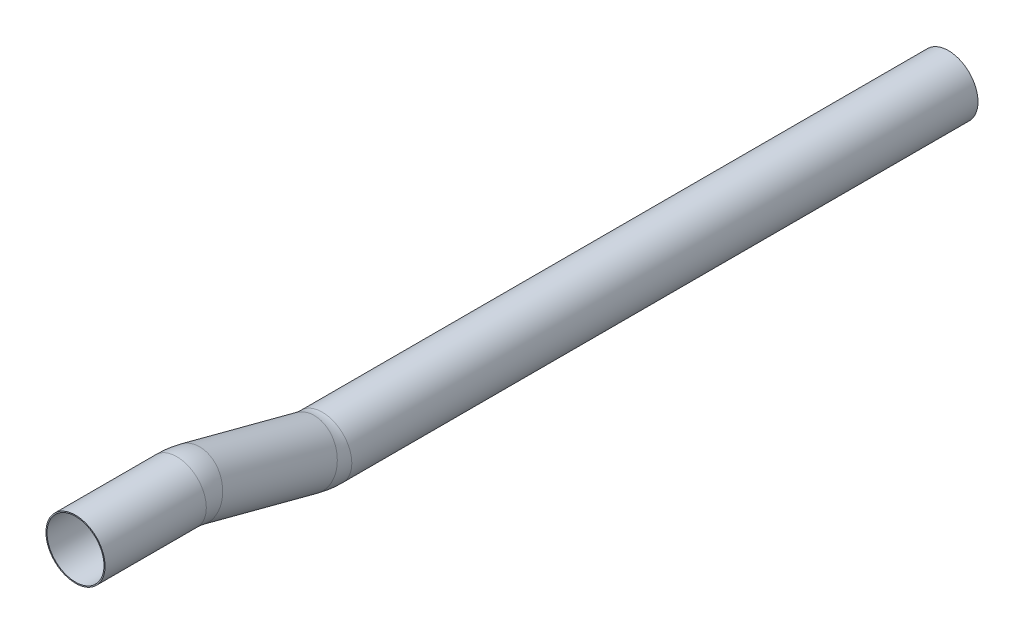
from build123d import *

# Parameters (mm, degrees)
SKETCH1_R   = 123.825
SKETCH1_R_2 = 119.38


with BuildPart() as part:
    # Sweep1: sweep along a path in Sketch2
    with BuildLine(Plane(origin=(0, 0, 0), x_dir=(0, 0, -1), z_dir=(1, 0, 0))) as sweep1_path:
        Line((0, 0), (424.305533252, 0))
        ThreePointArc((424.305533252, 0), (456.92757324, -2.103587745), (489.009272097, -8.379507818))
        Line((489.009272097, -8.379507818), (969.201794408, -134.876492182))
        ThreePointArc((969.201794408, -134.876492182), (1001.283493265, -141.152412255), (1033.905533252, -143.256))
        Line((1033.905533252, -143.256), (3657.6, -143.256))
    # Sketch1 → Sweep1 (sweep)
    with BuildSketch(Plane.XY):
        Circle(SKETCH1_R)
        Circle(SKETCH1_R_2, mode=Mode.SUBTRACT)
    sweep(path=sweep1_path.line)


solid = part.part
